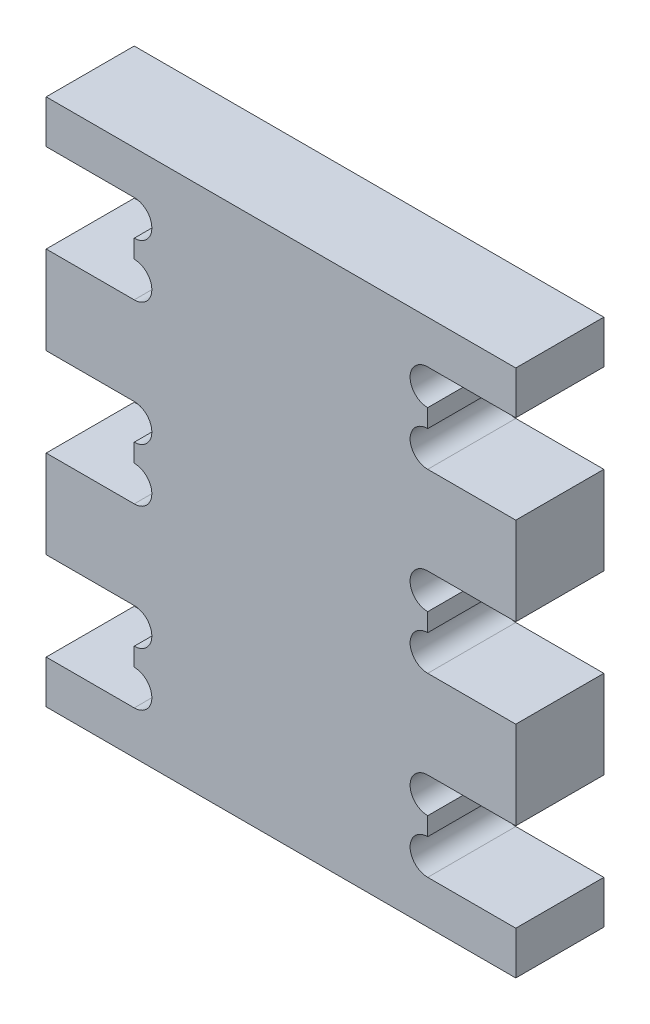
ISO-10303-21;
HEADER;
FILE_DESCRIPTION(('STEP AP214'),'2;1');
FILE_NAME('part.step','',(''),(''),'','','');
FILE_SCHEMA(('AUTOMOTIVE_DESIGN { 1 0 10303 214 1 1 1 1 }'));
ENDSEC;
DATA;
#1=APPLICATION_CONTEXT('core data for automotive mechanical design processes');
#2=APPLICATION_PROTOCOL_DEFINITION('international standard','automotive_design',2000,#1);
#3=PRODUCT_CONTEXT('',#1,'mechanical');
#4=PRODUCT('Part','Part','',(#3));
#5=PRODUCT_RELATED_PRODUCT_CATEGORY('part','',(#4));
#6=PRODUCT_DEFINITION_FORMATION('','',#4);
#7=PRODUCT_DEFINITION_CONTEXT('part definition',#1,'design');
#8=PRODUCT_DEFINITION('design','',#6,#7);
#9=PRODUCT_DEFINITION_SHAPE('','',#8);
#10=(LENGTH_UNIT() NAMED_UNIT(*) SI_UNIT(.MILLI.,.METRE.));
#11=(NAMED_UNIT(*) PLANE_ANGLE_UNIT() SI_UNIT($,.RADIAN.));
#12=(NAMED_UNIT(*) SI_UNIT($,.STERADIAN.) SOLID_ANGLE_UNIT());
#13=UNCERTAINTY_MEASURE_WITH_UNIT(LENGTH_MEASURE(1.E-05),#10,'distance_accuracy_value','');
#14=(GEOMETRIC_REPRESENTATION_CONTEXT(3) GLOBAL_UNCERTAINTY_ASSIGNED_CONTEXT((#13)) GLOBAL_UNIT_ASSIGNED_CONTEXT((#10,
#11,#12)) REPRESENTATION_CONTEXT('',''));
#15=CARTESIAN_POINT('',(0.,0.,0.));
#16=DIRECTION('',(0.,0.,1.));
#17=DIRECTION('',(1.,0.,0.));
#18=AXIS2_PLACEMENT_3D('',#15,#16,#17);
#19=CARTESIAN_POINT('',(50.,0.,15.));
#20=DIRECTION('',(0.,1.,0.));
#21=DIRECTION('',(0.,0.,1.));
#22=AXIS2_PLACEMENT_3D('',#19,#20,#21);
#23=PLANE('',#22);
#24=DIRECTION('',(1.,0.,0.));
#25=VECTOR('',#24,1.);
#26=CARTESIAN_POINT('',(50.,0.,0.));
#27=LINE('',#26,#25);
#28=CARTESIAN_POINT('',(-15.,0.,0.));
#29=VERTEX_POINT('',#28);
#30=CARTESIAN_POINT('',(65.,0.,0.));
#31=VERTEX_POINT('',#30);
#32=EDGE_CURVE('E181',#29,#31,#27,.T.);
#33=ORIENTED_EDGE('',*,*,#32,.T.);
#34=DIRECTION('',(0.,0.,-1.));
#35=VECTOR('',#34,1.);
#36=CARTESIAN_POINT('',(65.,0.,15.));
#37=LINE('',#36,#35);
#38=CARTESIAN_POINT('',(65.,0.,15.));
#39=VERTEX_POINT('',#38);
#40=EDGE_CURVE('E11',#39,#31,#37,.T.);
#41=ORIENTED_EDGE('',*,*,#40,.F.);
#42=DIRECTION('',(1.,0.,0.));
#43=VECTOR('',#42,1.);
#44=CARTESIAN_POINT('',(-15.,0.,15.));
#45=LINE('',#44,#43);
#46=CARTESIAN_POINT('',(-15.,0.,15.));
#47=VERTEX_POINT('',#46);
#48=EDGE_CURVE('E187',#47,#39,#45,.T.);
#49=ORIENTED_EDGE('',*,*,#48,.F.);
#50=DIRECTION('',(0.,0.,-1.));
#51=VECTOR('',#50,1.);
#52=CARTESIAN_POINT('',(-15.,0.,15.));
#53=LINE('',#52,#51);
#54=EDGE_CURVE('E317',#47,#29,#53,.T.);
#55=ORIENTED_EDGE('',*,*,#54,.T.);
#56=EDGE_LOOP('',(#33,#41,#49,#55));
#57=FACE_BOUND('',#56,.T.);
#58=ADVANCED_FACE('F33',(#57),#23,.F.);
#59=CARTESIAN_POINT('',(65.,0.,15.));
#60=DIRECTION('',(-1.,0.,0.));
#61=DIRECTION('',(0.,0.,1.));
#62=AXIS2_PLACEMENT_3D('',#59,#60,#61);
#63=PLANE('',#62);
#64=DIRECTION('',(0.,1.,0.));
#65=VECTOR('',#64,1.);
#66=CARTESIAN_POINT('',(65.,0.,0.));
#67=LINE('',#66,#65);
#68=CARTESIAN_POINT('',(65.,7.35,0.));
#69=VERTEX_POINT('',#68);
#70=EDGE_CURVE('E322',#31,#69,#67,.T.);
#71=ORIENTED_EDGE('',*,*,#70,.T.);
#72=DIRECTION('',(0.,0.,-1.));
#73=VECTOR('',#72,1.);
#74=CARTESIAN_POINT('',(65.,7.35,15.));
#75=LINE('',#74,#73);
#76=CARTESIAN_POINT('',(65.,7.35,15.));
#77=VERTEX_POINT('',#76);
#78=EDGE_CURVE('E41',#77,#69,#75,.T.);
#79=ORIENTED_EDGE('',*,*,#78,.F.);
#80=DIRECTION('',(0.,1.,0.));
#81=VECTOR('',#80,1.);
#82=CARTESIAN_POINT('',(65.,0.,15.));
#83=LINE('',#82,#81);
#84=EDGE_CURVE('E607',#39,#77,#83,.T.);
#85=ORIENTED_EDGE('',*,*,#84,.F.);
#86=ORIENTED_EDGE('',*,*,#40,.T.);
#87=EDGE_LOOP('',(#71,#79,#85,#86));
#88=FACE_BOUND('',#87,.T.);
#89=ADVANCED_FACE('F610',(#88),#63,.F.);
#90=CARTESIAN_POINT('',(65.,7.35,15.));
#91=DIRECTION('',(0.,-1.,0.));
#92=DIRECTION('',(1.,0.,0.));
#93=AXIS2_PLACEMENT_3D('',#90,#91,#92);
#94=PLANE('',#93);
#95=DIRECTION('',(-1.,0.,0.));
#96=VECTOR('',#95,1.);
#97=CARTESIAN_POINT('',(65.,7.35,0.));
#98=LINE('',#97,#96);
#99=CARTESIAN_POINT('',(50.,7.35,0.));
#100=VERTEX_POINT('',#99);
#101=EDGE_CURVE('E324',#69,#100,#98,.T.);
#102=ORIENTED_EDGE('',*,*,#101,.T.);
#103=DIRECTION('',(0.,0.,-1.));
#104=VECTOR('',#103,1.);
#105=CARTESIAN_POINT('',(50.,7.35,15.));
#106=LINE('',#105,#104);
#107=CARTESIAN_POINT('',(50.,7.35,15.));
#108=VERTEX_POINT('',#107);
#109=EDGE_CURVE('E502',#108,#100,#106,.T.);
#110=ORIENTED_EDGE('',*,*,#109,.F.);
#111=DIRECTION('',(-1.,0.,0.));
#112=VECTOR('',#111,1.);
#113=CARTESIAN_POINT('',(65.,7.35,15.));
#114=LINE('',#113,#112);
#115=EDGE_CURVE('E511',#77,#108,#114,.T.);
#116=ORIENTED_EDGE('',*,*,#115,.F.);
#117=ORIENTED_EDGE('',*,*,#78,.T.);
#118=EDGE_LOOP('',(#102,#110,#116,#117));
#119=FACE_BOUND('',#118,.T.);
#120=ADVANCED_FACE('F509',(#119),#94,.F.);
#121=CARTESIAN_POINT('',(50.,10.35,15.));
#122=DIRECTION('',(0.,0.,-1.));
#123=DIRECTION('',(-1.,0.,0.));
#124=AXIS2_PLACEMENT_3D('',#121,#122,#123);
#125=CYLINDRICAL_SURFACE('',#124,3.);
#126=CARTESIAN_POINT('',(50.,10.35,0.));
#127=DIRECTION('',(0.,0.,-1.));
#128=DIRECTION('',(-1.,0.,0.));
#129=AXIS2_PLACEMENT_3D('',#126,#127,#128);
#130=CIRCLE('',#129,3.);
#131=CARTESIAN_POINT('',(50.,13.35,0.));
#132=VERTEX_POINT('',#131);
#133=EDGE_CURVE('E326',#100,#132,#130,.T.);
#134=ORIENTED_EDGE('',*,*,#133,.T.);
#135=DIRECTION('',(0.,0.,-1.));
#136=VECTOR('',#135,1.);
#137=CARTESIAN_POINT('',(50.,13.35,15.));
#138=LINE('',#137,#136);
#139=CARTESIAN_POINT('',(50.,13.35,15.));
#140=VERTEX_POINT('',#139);
#141=EDGE_CURVE('E499',#140,#132,#138,.T.);
#142=ORIENTED_EDGE('',*,*,#141,.F.);
#143=CARTESIAN_POINT('',(50.,10.35,15.));
#144=DIRECTION('',(0.,0.,-1.));
#145=DIRECTION('',(-1.,0.,0.));
#146=AXIS2_PLACEMENT_3D('',#143,#144,#145);
#147=CIRCLE('',#146,3.);
#148=EDGE_CURVE('E529',#108,#140,#147,.T.);
#149=ORIENTED_EDGE('',*,*,#148,.F.);
#150=ORIENTED_EDGE('',*,*,#109,.T.);
#151=EDGE_LOOP('',(#134,#142,#149,#150));
#152=FACE_BOUND('',#151,.T.);
#153=ADVANCED_FACE('F520',(#152),#125,.F.);
#154=CARTESIAN_POINT('',(50.,13.35,15.));
#155=DIRECTION('',(-1.,0.,0.));
#156=DIRECTION('',(0.,0.,1.));
#157=AXIS2_PLACEMENT_3D('',#154,#155,#156);
#158=PLANE('',#157);
#159=DIRECTION('',(0.,1.,0.));
#160=VECTOR('',#159,1.);
#161=CARTESIAN_POINT('',(50.,13.35,0.));
#162=LINE('',#161,#160);
#163=CARTESIAN_POINT('',(50.,16.45,0.));
#164=VERTEX_POINT('',#163);
#165=EDGE_CURVE('E328',#132,#164,#162,.T.);
#166=ORIENTED_EDGE('',*,*,#165,.T.);
#167=DIRECTION('',(0.,0.,-1.));
#168=VECTOR('',#167,1.);
#169=CARTESIAN_POINT('',(50.,16.45,15.));
#170=LINE('',#169,#168);
#171=CARTESIAN_POINT('',(50.,16.45,15.));
#172=VERTEX_POINT('',#171);
#173=EDGE_CURVE('E496',#172,#164,#170,.T.);
#174=ORIENTED_EDGE('',*,*,#173,.F.);
#175=DIRECTION('',(0.,1.,0.));
#176=VECTOR('',#175,1.);
#177=CARTESIAN_POINT('',(50.,13.35,15.));
#178=LINE('',#177,#176);
#179=EDGE_CURVE('E526',#140,#172,#178,.T.);
#180=ORIENTED_EDGE('',*,*,#179,.F.);
#181=ORIENTED_EDGE('',*,*,#141,.T.);
#182=EDGE_LOOP('',(#166,#174,#180,#181));
#183=FACE_BOUND('',#182,.T.);
#184=ADVANCED_FACE('F524',(#183),#158,.F.);
#185=CARTESIAN_POINT('',(50.,19.45,15.));
#186=DIRECTION('',(0.,0.,-1.));
#187=DIRECTION('',(-1.,0.,0.));
#188=AXIS2_PLACEMENT_3D('',#185,#186,#187);
#189=CYLINDRICAL_SURFACE('',#188,3.);
#190=CARTESIAN_POINT('',(50.,19.45,0.));
#191=DIRECTION('',(0.,0.,-1.));
#192=DIRECTION('',(-1.,0.,0.));
#193=AXIS2_PLACEMENT_3D('',#190,#191,#192);
#194=CIRCLE('',#193,3.);
#195=CARTESIAN_POINT('',(50.,22.45,0.));
#196=VERTEX_POINT('',#195);
#197=EDGE_CURVE('E330',#164,#196,#194,.T.);
#198=ORIENTED_EDGE('',*,*,#197,.T.);
#199=DIRECTION('',(0.,0.,-1.));
#200=VECTOR('',#199,1.);
#201=CARTESIAN_POINT('',(50.,22.45,15.));
#202=LINE('',#201,#200);
#203=CARTESIAN_POINT('',(50.,22.45,15.));
#204=VERTEX_POINT('',#203);
#205=EDGE_CURVE('E493',#204,#196,#202,.T.);
#206=ORIENTED_EDGE('',*,*,#205,.F.);
#207=CARTESIAN_POINT('',(50.,19.45,15.));
#208=DIRECTION('',(0.,0.,-1.));
#209=DIRECTION('',(-1.,0.,0.));
#210=AXIS2_PLACEMENT_3D('',#207,#208,#209);
#211=CIRCLE('',#210,3.);
#212=EDGE_CURVE('E528',#172,#204,#211,.T.);
#213=ORIENTED_EDGE('',*,*,#212,.F.);
#214=ORIENTED_EDGE('',*,*,#173,.T.);
#215=EDGE_LOOP('',(#198,#206,#213,#214));
#216=FACE_BOUND('',#215,.T.);
#217=ADVANCED_FACE('F622',(#216),#189,.F.);
#218=CARTESIAN_POINT('',(50.,22.45,15.));
#219=DIRECTION('',(0.,1.,0.));
#220=DIRECTION('',(0.,0.,1.));
#221=AXIS2_PLACEMENT_3D('',#218,#219,#220);
#222=PLANE('',#221);
#223=DIRECTION('',(1.,0.,0.));
#224=VECTOR('',#223,1.);
#225=CARTESIAN_POINT('',(50.,22.45,0.));
#226=LINE('',#225,#224);
#227=CARTESIAN_POINT('',(65.,22.45,0.));
#228=VERTEX_POINT('',#227);
#229=EDGE_CURVE('E332',#196,#228,#226,.T.);
#230=ORIENTED_EDGE('',*,*,#229,.T.);
#231=DIRECTION('',(0.,0.,-1.));
#232=VECTOR('',#231,1.);
#233=CARTESIAN_POINT('',(65.,22.45,15.));
#234=LINE('',#233,#232);
#235=CARTESIAN_POINT('',(65.,22.45,15.));
#236=VERTEX_POINT('',#235);
#237=EDGE_CURVE('E490',#236,#228,#234,.T.);
#238=ORIENTED_EDGE('',*,*,#237,.F.);
#239=DIRECTION('',(1.,0.,0.));
#240=VECTOR('',#239,1.);
#241=CARTESIAN_POINT('',(50.,22.45,15.));
#242=LINE('',#241,#240);
#243=EDGE_CURVE('E531',#204,#236,#242,.T.);
#244=ORIENTED_EDGE('',*,*,#243,.F.);
#245=ORIENTED_EDGE('',*,*,#205,.T.);
#246=EDGE_LOOP('',(#230,#238,#244,#245));
#247=FACE_BOUND('',#246,.T.);
#248=ADVANCED_FACE('F625',(#247),#222,.F.);
#249=CARTESIAN_POINT('',(65.,22.45,15.));
#250=DIRECTION('',(-1.,0.,0.));
#251=DIRECTION('',(0.,0.,1.));
#252=AXIS2_PLACEMENT_3D('',#249,#250,#251);
#253=PLANE('',#252);
#254=DIRECTION('',(0.,1.,0.));
#255=VECTOR('',#254,1.);
#256=CARTESIAN_POINT('',(65.,22.45,0.));
#257=LINE('',#256,#255);
#258=CARTESIAN_POINT('',(65.,37.45,0.));
#259=VERTEX_POINT('',#258);
#260=EDGE_CURVE('E334',#228,#259,#257,.T.);
#261=ORIENTED_EDGE('',*,*,#260,.T.);
#262=DIRECTION('',(0.,0.,-1.));
#263=VECTOR('',#262,1.);
#264=CARTESIAN_POINT('',(65.,37.45,15.));
#265=LINE('',#264,#263);
#266=CARTESIAN_POINT('',(65.,37.45,15.));
#267=VERTEX_POINT('',#266);
#268=EDGE_CURVE('E487',#267,#259,#265,.T.);
#269=ORIENTED_EDGE('',*,*,#268,.F.);
#270=DIRECTION('',(0.,1.,0.));
#271=VECTOR('',#270,1.);
#272=CARTESIAN_POINT('',(65.,22.45,15.));
#273=LINE('',#272,#271);
#274=EDGE_CURVE('E537',#236,#267,#273,.T.);
#275=ORIENTED_EDGE('',*,*,#274,.F.);
#276=ORIENTED_EDGE('',*,*,#237,.T.);
#277=EDGE_LOOP('',(#261,#269,#275,#276));
#278=FACE_BOUND('',#277,.T.);
#279=ADVANCED_FACE('F629',(#278),#253,.F.);
#280=CARTESIAN_POINT('',(65.,37.45,15.));
#281=DIRECTION('',(0.,-1.,0.));
#282=DIRECTION('',(1.,0.,0.));
#283=AXIS2_PLACEMENT_3D('',#280,#281,#282);
#284=PLANE('',#283);
#285=DIRECTION('',(-1.,0.,0.));
#286=VECTOR('',#285,1.);
#287=CARTESIAN_POINT('',(65.,37.45,0.));
#288=LINE('',#287,#286);
#289=CARTESIAN_POINT('',(50.,37.45,0.));
#290=VERTEX_POINT('',#289);
#291=EDGE_CURVE('E336',#259,#290,#288,.T.);
#292=ORIENTED_EDGE('',*,*,#291,.T.);
#293=DIRECTION('',(0.,0.,-1.));
#294=VECTOR('',#293,1.);
#295=CARTESIAN_POINT('',(50.,37.45,15.));
#296=LINE('',#295,#294);
#297=CARTESIAN_POINT('',(50.,37.45,15.));
#298=VERTEX_POINT('',#297);
#299=EDGE_CURVE('E484',#298,#290,#296,.T.);
#300=ORIENTED_EDGE('',*,*,#299,.F.);
#301=DIRECTION('',(-1.,0.,0.));
#302=VECTOR('',#301,1.);
#303=CARTESIAN_POINT('',(65.,37.45,15.));
#304=LINE('',#303,#302);
#305=EDGE_CURVE('E539',#267,#298,#304,.T.);
#306=ORIENTED_EDGE('',*,*,#305,.F.);
#307=ORIENTED_EDGE('',*,*,#268,.T.);
#308=EDGE_LOOP('',(#292,#300,#306,#307));
#309=FACE_BOUND('',#308,.T.);
#310=ADVANCED_FACE('F633',(#309),#284,.F.);
#311=CARTESIAN_POINT('',(50.,40.45,15.));
#312=DIRECTION('',(0.,0.,-1.));
#313=DIRECTION('',(-1.,0.,0.));
#314=AXIS2_PLACEMENT_3D('',#311,#312,#313);
#315=CYLINDRICAL_SURFACE('',#314,3.);
#316=CARTESIAN_POINT('',(50.,40.45,0.));
#317=DIRECTION('',(0.,0.,-1.));
#318=DIRECTION('',(-1.,0.,0.));
#319=AXIS2_PLACEMENT_3D('',#316,#317,#318);
#320=CIRCLE('',#319,3.);
#321=CARTESIAN_POINT('',(50.,43.45,0.));
#322=VERTEX_POINT('',#321);
#323=EDGE_CURVE('E338',#290,#322,#320,.T.);
#324=ORIENTED_EDGE('',*,*,#323,.T.);
#325=DIRECTION('',(0.,0.,-1.));
#326=VECTOR('',#325,1.);
#327=CARTESIAN_POINT('',(50.,43.45,15.));
#328=LINE('',#327,#326);
#329=CARTESIAN_POINT('',(50.,43.45,15.));
#330=VERTEX_POINT('',#329);
#331=EDGE_CURVE('E481',#330,#322,#328,.T.);
#332=ORIENTED_EDGE('',*,*,#331,.F.);
#333=CARTESIAN_POINT('',(50.,40.45,15.));
#334=DIRECTION('',(0.,0.,-1.));
#335=DIRECTION('',(-1.,0.,0.));
#336=AXIS2_PLACEMENT_3D('',#333,#334,#335);
#337=CIRCLE('',#336,3.);
#338=EDGE_CURVE('E541',#298,#330,#337,.T.);
#339=ORIENTED_EDGE('',*,*,#338,.F.);
#340=ORIENTED_EDGE('',*,*,#299,.T.);
#341=EDGE_LOOP('',(#324,#332,#339,#340));
#342=FACE_BOUND('',#341,.T.);
#343=ADVANCED_FACE('F637',(#342),#315,.F.);
#344=CARTESIAN_POINT('',(50.,43.45,15.));
#345=DIRECTION('',(-1.,0.,0.));
#346=DIRECTION('',(0.,0.,1.));
#347=AXIS2_PLACEMENT_3D('',#344,#345,#346);
#348=PLANE('',#347);
#349=DIRECTION('',(0.,1.,0.));
#350=VECTOR('',#349,1.);
#351=CARTESIAN_POINT('',(50.,43.45,0.));
#352=LINE('',#351,#350);
#353=CARTESIAN_POINT('',(50.,46.55,0.));
#354=VERTEX_POINT('',#353);
#355=EDGE_CURVE('E340',#322,#354,#352,.T.);
#356=ORIENTED_EDGE('',*,*,#355,.T.);
#357=DIRECTION('',(0.,0.,-1.));
#358=VECTOR('',#357,1.);
#359=CARTESIAN_POINT('',(50.,46.55,15.));
#360=LINE('',#359,#358);
#361=CARTESIAN_POINT('',(50.,46.55,15.));
#362=VERTEX_POINT('',#361);
#363=EDGE_CURVE('E478',#362,#354,#360,.T.);
#364=ORIENTED_EDGE('',*,*,#363,.F.);
#365=DIRECTION('',(0.,1.,0.));
#366=VECTOR('',#365,1.);
#367=CARTESIAN_POINT('',(50.,43.45,15.));
#368=LINE('',#367,#366);
#369=EDGE_CURVE('E543',#330,#362,#368,.T.);
#370=ORIENTED_EDGE('',*,*,#369,.F.);
#371=ORIENTED_EDGE('',*,*,#331,.T.);
#372=EDGE_LOOP('',(#356,#364,#370,#371));
#373=FACE_BOUND('',#372,.T.);
#374=ADVANCED_FACE('F641',(#373),#348,.F.);
#375=CARTESIAN_POINT('',(50.,49.55,15.));
#376=DIRECTION('',(0.,0.,-1.));
#377=DIRECTION('',(-1.,0.,0.));
#378=AXIS2_PLACEMENT_3D('',#375,#376,#377);
#379=CYLINDRICAL_SURFACE('',#378,3.);
#380=CARTESIAN_POINT('',(50.,49.55,0.));
#381=DIRECTION('',(0.,0.,-1.));
#382=DIRECTION('',(1.,0.,0.));
#383=AXIS2_PLACEMENT_3D('',#380,#381,#382);
#384=CIRCLE('',#383,3.);
#385=CARTESIAN_POINT('',(50.,52.55,0.));
#386=VERTEX_POINT('',#385);
#387=EDGE_CURVE('E342',#354,#386,#384,.T.);
#388=ORIENTED_EDGE('',*,*,#387,.T.);
#389=DIRECTION('',(0.,0.,-1.));
#390=VECTOR('',#389,1.);
#391=CARTESIAN_POINT('',(50.,52.55,15.));
#392=LINE('',#391,#390);
#393=CARTESIAN_POINT('',(50.,52.55,15.));
#394=VERTEX_POINT('',#393);
#395=EDGE_CURVE('E475',#394,#386,#392,.T.);
#396=ORIENTED_EDGE('',*,*,#395,.F.);
#397=CARTESIAN_POINT('',(50.,49.55,15.));
#398=DIRECTION('',(0.,0.,-1.));
#399=DIRECTION('',(1.,0.,0.));
#400=AXIS2_PLACEMENT_3D('',#397,#398,#399);
#401=CIRCLE('',#400,3.);
#402=EDGE_CURVE('E545',#362,#394,#401,.T.);
#403=ORIENTED_EDGE('',*,*,#402,.F.);
#404=ORIENTED_EDGE('',*,*,#363,.T.);
#405=EDGE_LOOP('',(#388,#396,#403,#404));
#406=FACE_BOUND('',#405,.T.);
#407=ADVANCED_FACE('F645',(#406),#379,.F.);
#408=CARTESIAN_POINT('',(50.,52.55,15.));
#409=DIRECTION('',(0.,1.,0.));
#410=DIRECTION('',(0.,0.,1.));
#411=AXIS2_PLACEMENT_3D('',#408,#409,#410);
#412=PLANE('',#411);
#413=DIRECTION('',(1.,0.,0.));
#414=VECTOR('',#413,1.);
#415=CARTESIAN_POINT('',(50.,52.55,0.));
#416=LINE('',#415,#414);
#417=CARTESIAN_POINT('',(65.,52.55,0.));
#418=VERTEX_POINT('',#417);
#419=EDGE_CURVE('E344',#386,#418,#416,.T.);
#420=ORIENTED_EDGE('',*,*,#419,.T.);
#421=DIRECTION('',(0.,0.,-1.));
#422=VECTOR('',#421,1.);
#423=CARTESIAN_POINT('',(65.,52.55,15.));
#424=LINE('',#423,#422);
#425=CARTESIAN_POINT('',(65.,52.55,15.));
#426=VERTEX_POINT('',#425);
#427=EDGE_CURVE('E472',#426,#418,#424,.T.);
#428=ORIENTED_EDGE('',*,*,#427,.F.);
#429=DIRECTION('',(1.,0.,0.));
#430=VECTOR('',#429,1.);
#431=CARTESIAN_POINT('',(50.,52.55,15.));
#432=LINE('',#431,#430);
#433=EDGE_CURVE('E547',#394,#426,#432,.T.);
#434=ORIENTED_EDGE('',*,*,#433,.F.);
#435=ORIENTED_EDGE('',*,*,#395,.T.);
#436=EDGE_LOOP('',(#420,#428,#434,#435));
#437=FACE_BOUND('',#436,.T.);
#438=ADVANCED_FACE('F649',(#437),#412,.F.);
#439=CARTESIAN_POINT('',(65.,52.55,15.));
#440=DIRECTION('',(-1.,0.,0.));
#441=DIRECTION('',(0.,0.,1.));
#442=AXIS2_PLACEMENT_3D('',#439,#440,#441);
#443=PLANE('',#442);
#444=DIRECTION('',(0.,1.,0.));
#445=VECTOR('',#444,1.);
#446=CARTESIAN_POINT('',(65.,52.55,0.));
#447=LINE('',#446,#445);
#448=CARTESIAN_POINT('',(65.,67.55,0.));
#449=VERTEX_POINT('',#448);
#450=EDGE_CURVE('E346',#418,#449,#447,.T.);
#451=ORIENTED_EDGE('',*,*,#450,.T.);
#452=DIRECTION('',(0.,0.,-1.));
#453=VECTOR('',#452,1.);
#454=CARTESIAN_POINT('',(65.,67.55,15.));
#455=LINE('',#454,#453);
#456=CARTESIAN_POINT('',(65.,67.55,15.));
#457=VERTEX_POINT('',#456);
#458=EDGE_CURVE('E469',#457,#449,#455,.T.);
#459=ORIENTED_EDGE('',*,*,#458,.F.);
#460=DIRECTION('',(0.,1.,0.));
#461=VECTOR('',#460,1.);
#462=CARTESIAN_POINT('',(65.,52.55,15.));
#463=LINE('',#462,#461);
#464=EDGE_CURVE('E549',#426,#457,#463,.T.);
#465=ORIENTED_EDGE('',*,*,#464,.F.);
#466=ORIENTED_EDGE('',*,*,#427,.T.);
#467=EDGE_LOOP('',(#451,#459,#465,#466));
#468=FACE_BOUND('',#467,.T.);
#469=ADVANCED_FACE('F653',(#468),#443,.F.);
#470=CARTESIAN_POINT('',(65.,67.55,15.));
#471=DIRECTION('',(0.,-1.,0.));
#472=DIRECTION('',(0.,0.,-1.));
#473=AXIS2_PLACEMENT_3D('',#470,#471,#472);
#474=PLANE('',#473);
#475=DIRECTION('',(-1.,0.,0.));
#476=VECTOR('',#475,1.);
#477=CARTESIAN_POINT('',(65.,67.55,0.));
#478=LINE('',#477,#476);
#479=CARTESIAN_POINT('',(50.,67.55,0.));
#480=VERTEX_POINT('',#479);
#481=EDGE_CURVE('E348',#449,#480,#478,.T.);
#482=ORIENTED_EDGE('',*,*,#481,.T.);
#483=DIRECTION('',(0.,0.,-1.));
#484=VECTOR('',#483,1.);
#485=CARTESIAN_POINT('',(50.,67.55,15.));
#486=LINE('',#485,#484);
#487=CARTESIAN_POINT('',(50.,67.55,15.));
#488=VERTEX_POINT('',#487);
#489=EDGE_CURVE('E466',#488,#480,#486,.T.);
#490=ORIENTED_EDGE('',*,*,#489,.F.);
#491=DIRECTION('',(-1.,0.,0.));
#492=VECTOR('',#491,1.);
#493=CARTESIAN_POINT('',(65.,67.55,15.));
#494=LINE('',#493,#492);
#495=EDGE_CURVE('E551',#457,#488,#494,.T.);
#496=ORIENTED_EDGE('',*,*,#495,.F.);
#497=ORIENTED_EDGE('',*,*,#458,.T.);
#498=EDGE_LOOP('',(#482,#490,#496,#497));
#499=FACE_BOUND('',#498,.T.);
#500=ADVANCED_FACE('F657',(#499),#474,.F.);
#501=CARTESIAN_POINT('',(50.,70.55,15.));
#502=DIRECTION('',(0.,0.,-1.));
#503=DIRECTION('',(-1.,0.,0.));
#504=AXIS2_PLACEMENT_3D('',#501,#502,#503);
#505=CYLINDRICAL_SURFACE('',#504,3.);
#506=CARTESIAN_POINT('',(50.,70.55,0.));
#507=DIRECTION('',(0.,0.,-1.));
#508=DIRECTION('',(-1.,0.,0.));
#509=AXIS2_PLACEMENT_3D('',#506,#507,#508);
#510=CIRCLE('',#509,3.);
#511=CARTESIAN_POINT('',(50.,73.55,0.));
#512=VERTEX_POINT('',#511);
#513=EDGE_CURVE('E350',#480,#512,#510,.T.);
#514=ORIENTED_EDGE('',*,*,#513,.T.);
#515=DIRECTION('',(0.,0.,-1.));
#516=VECTOR('',#515,1.);
#517=CARTESIAN_POINT('',(50.,73.55,15.));
#518=LINE('',#517,#516);
#519=CARTESIAN_POINT('',(50.,73.55,15.));
#520=VERTEX_POINT('',#519);
#521=EDGE_CURVE('E463',#520,#512,#518,.T.);
#522=ORIENTED_EDGE('',*,*,#521,.F.);
#523=CARTESIAN_POINT('',(50.,70.55,15.));
#524=DIRECTION('',(0.,0.,-1.));
#525=DIRECTION('',(-1.,0.,0.));
#526=AXIS2_PLACEMENT_3D('',#523,#524,#525);
#527=CIRCLE('',#526,3.);
#528=EDGE_CURVE('E553',#488,#520,#527,.T.);
#529=ORIENTED_EDGE('',*,*,#528,.F.);
#530=ORIENTED_EDGE('',*,*,#489,.T.);
#531=EDGE_LOOP('',(#514,#522,#529,#530));
#532=FACE_BOUND('',#531,.T.);
#533=ADVANCED_FACE('F661',(#532),#505,.F.);
#534=CARTESIAN_POINT('',(50.,73.55,15.));
#535=DIRECTION('',(-1.,0.,0.));
#536=DIRECTION('',(0.,0.,1.));
#537=AXIS2_PLACEMENT_3D('',#534,#535,#536);
#538=PLANE('',#537);
#539=DIRECTION('',(0.,1.,0.));
#540=VECTOR('',#539,1.);
#541=CARTESIAN_POINT('',(50.,73.55,0.));
#542=LINE('',#541,#540);
#543=CARTESIAN_POINT('',(50.,76.65,0.));
#544=VERTEX_POINT('',#543);
#545=EDGE_CURVE('E352',#512,#544,#542,.T.);
#546=ORIENTED_EDGE('',*,*,#545,.T.);
#547=DIRECTION('',(0.,0.,-1.));
#548=VECTOR('',#547,1.);
#549=CARTESIAN_POINT('',(50.,76.65,15.));
#550=LINE('',#549,#548);
#551=CARTESIAN_POINT('',(50.,76.65,15.));
#552=VERTEX_POINT('',#551);
#553=EDGE_CURVE('E460',#552,#544,#550,.T.);
#554=ORIENTED_EDGE('',*,*,#553,.F.);
#555=DIRECTION('',(0.,1.,0.));
#556=VECTOR('',#555,1.);
#557=CARTESIAN_POINT('',(50.,73.55,15.));
#558=LINE('',#557,#556);
#559=EDGE_CURVE('E555',#520,#552,#558,.T.);
#560=ORIENTED_EDGE('',*,*,#559,.F.);
#561=ORIENTED_EDGE('',*,*,#521,.T.);
#562=EDGE_LOOP('',(#546,#554,#560,#561));
#563=FACE_BOUND('',#562,.T.);
#564=ADVANCED_FACE('F665',(#563),#538,.F.);
#565=CARTESIAN_POINT('',(50.,79.65,15.));
#566=DIRECTION('',(0.,0.,-1.));
#567=DIRECTION('',(-1.,0.,0.));
#568=AXIS2_PLACEMENT_3D('',#565,#566,#567);
#569=CYLINDRICAL_SURFACE('',#568,3.);
#570=CARTESIAN_POINT('',(50.,79.65,0.));
#571=DIRECTION('',(0.,0.,-1.));
#572=DIRECTION('',(-1.,0.,0.));
#573=AXIS2_PLACEMENT_3D('',#570,#571,#572);
#574=CIRCLE('',#573,3.);
#575=CARTESIAN_POINT('',(50.,82.65,0.));
#576=VERTEX_POINT('',#575);
#577=EDGE_CURVE('E354',#544,#576,#574,.T.);
#578=ORIENTED_EDGE('',*,*,#577,.T.);
#579=DIRECTION('',(0.,0.,-1.));
#580=VECTOR('',#579,1.);
#581=CARTESIAN_POINT('',(50.,82.65,15.));
#582=LINE('',#581,#580);
#583=CARTESIAN_POINT('',(50.,82.65,15.));
#584=VERTEX_POINT('',#583);
#585=EDGE_CURVE('E457',#584,#576,#582,.T.);
#586=ORIENTED_EDGE('',*,*,#585,.F.);
#587=CARTESIAN_POINT('',(50.,79.65,15.));
#588=DIRECTION('',(0.,0.,-1.));
#589=DIRECTION('',(-1.,0.,0.));
#590=AXIS2_PLACEMENT_3D('',#587,#588,#589);
#591=CIRCLE('',#590,3.);
#592=EDGE_CURVE('E557',#552,#584,#591,.T.);
#593=ORIENTED_EDGE('',*,*,#592,.F.);
#594=ORIENTED_EDGE('',*,*,#553,.T.);
#595=EDGE_LOOP('',(#578,#586,#593,#594));
#596=FACE_BOUND('',#595,.T.);
#597=ADVANCED_FACE('F669',(#596),#569,.F.);
#598=CARTESIAN_POINT('',(50.,82.65,15.));
#599=DIRECTION('',(0.,1.,0.));
#600=DIRECTION('',(0.,0.,1.));
#601=AXIS2_PLACEMENT_3D('',#598,#599,#600);
#602=PLANE('',#601);
#603=DIRECTION('',(1.,0.,0.));
#604=VECTOR('',#603,1.);
#605=CARTESIAN_POINT('',(50.,82.65,0.));
#606=LINE('',#605,#604);
#607=CARTESIAN_POINT('',(65.,82.65,0.));
#608=VERTEX_POINT('',#607);
#609=EDGE_CURVE('E356',#576,#608,#606,.T.);
#610=ORIENTED_EDGE('',*,*,#609,.T.);
#611=DIRECTION('',(0.,0.,-1.));
#612=VECTOR('',#611,1.);
#613=CARTESIAN_POINT('',(65.,82.65,15.));
#614=LINE('',#613,#612);
#615=CARTESIAN_POINT('',(65.,82.65,15.));
#616=VERTEX_POINT('',#615);
#617=EDGE_CURVE('E454',#616,#608,#614,.T.);
#618=ORIENTED_EDGE('',*,*,#617,.F.);
#619=DIRECTION('',(1.,0.,0.));
#620=VECTOR('',#619,1.);
#621=CARTESIAN_POINT('',(50.,82.65,15.));
#622=LINE('',#621,#620);
#623=EDGE_CURVE('E559',#584,#616,#622,.T.);
#624=ORIENTED_EDGE('',*,*,#623,.F.);
#625=ORIENTED_EDGE('',*,*,#585,.T.);
#626=EDGE_LOOP('',(#610,#618,#624,#625));
#627=FACE_BOUND('',#626,.T.);
#628=ADVANCED_FACE('F673',(#627),#602,.F.);
#629=CARTESIAN_POINT('',(65.,82.65,15.));
#630=DIRECTION('',(-1.,0.,0.));
#631=DIRECTION('',(0.,0.,1.));
#632=AXIS2_PLACEMENT_3D('',#629,#630,#631);
#633=PLANE('',#632);
#634=DIRECTION('',(0.,1.,0.));
#635=VECTOR('',#634,1.);
#636=CARTESIAN_POINT('',(65.,82.65,0.));
#637=LINE('',#636,#635);
#638=CARTESIAN_POINT('',(65.,90.,0.));
#639=VERTEX_POINT('',#638);
#640=EDGE_CURVE('E358',#608,#639,#637,.T.);
#641=ORIENTED_EDGE('',*,*,#640,.T.);
#642=DIRECTION('',(0.,0.,-1.));
#643=VECTOR('',#642,1.);
#644=CARTESIAN_POINT('',(65.,90.,15.));
#645=LINE('',#644,#643);
#646=CARTESIAN_POINT('',(65.,90.,15.));
#647=VERTEX_POINT('',#646);
#648=EDGE_CURVE('E451',#647,#639,#645,.T.);
#649=ORIENTED_EDGE('',*,*,#648,.F.);
#650=DIRECTION('',(0.,1.,0.));
#651=VECTOR('',#650,1.);
#652=CARTESIAN_POINT('',(65.,82.65,15.));
#653=LINE('',#652,#651);
#654=EDGE_CURVE('E561',#616,#647,#653,.T.);
#655=ORIENTED_EDGE('',*,*,#654,.F.);
#656=ORIENTED_EDGE('',*,*,#617,.T.);
#657=EDGE_LOOP('',(#641,#649,#655,#656));
#658=FACE_BOUND('',#657,.T.);
#659=ADVANCED_FACE('F677',(#658),#633,.F.);
#660=CARTESIAN_POINT('',(-15.,90.,15.));
#661=DIRECTION('',(0.,-1.,0.));
#662=DIRECTION('',(0.,0.,-1.));
#663=AXIS2_PLACEMENT_3D('',#660,#661,#662);
#664=PLANE('',#663);
#665=DIRECTION('',(-1.,0.,0.));
#666=VECTOR('',#665,1.);
#667=CARTESIAN_POINT('',(-15.,90.,0.));
#668=LINE('',#667,#666);
#669=CARTESIAN_POINT('',(-15.,90.,0.));
#670=VERTEX_POINT('',#669);
#671=EDGE_CURVE('E361',#639,#670,#668,.T.);
#672=ORIENTED_EDGE('',*,*,#671,.T.);
#673=DIRECTION('',(0.,0.,-1.));
#674=VECTOR('',#673,1.);
#675=CARTESIAN_POINT('',(-15.,90.,15.));
#676=LINE('',#675,#674);
#677=CARTESIAN_POINT('',(-15.,90.,15.));
#678=VERTEX_POINT('',#677);
#679=EDGE_CURVE('E448',#678,#670,#676,.T.);
#680=ORIENTED_EDGE('',*,*,#679,.F.);
#681=DIRECTION('',(-1.,0.,0.));
#682=VECTOR('',#681,1.);
#683=CARTESIAN_POINT('',(65.,90.,15.));
#684=LINE('',#683,#682);
#685=EDGE_CURVE('E563',#647,#678,#684,.T.);
#686=ORIENTED_EDGE('',*,*,#685,.F.);
#687=ORIENTED_EDGE('',*,*,#648,.T.);
#688=EDGE_LOOP('',(#672,#680,#686,#687));
#689=FACE_BOUND('',#688,.T.);
#690=ADVANCED_FACE('F681',(#689),#664,.F.);
#691=CARTESIAN_POINT('',(-15.,90.,15.));
#692=DIRECTION('',(1.,0.,0.));
#693=DIRECTION('',(0.,1.,0.));
#694=AXIS2_PLACEMENT_3D('',#691,#692,#693);
#695=PLANE('',#694);
#696=DIRECTION('',(0.,-1.,0.));
#697=VECTOR('',#696,1.);
#698=CARTESIAN_POINT('',(-15.,90.,0.));
#699=LINE('',#698,#697);
#700=CARTESIAN_POINT('',(-15.,82.65,0.));
#701=VERTEX_POINT('',#700);
#702=EDGE_CURVE('E363',#670,#701,#699,.T.);
#703=ORIENTED_EDGE('',*,*,#702,.T.);
#704=DIRECTION('',(0.,0.,-1.));
#705=VECTOR('',#704,1.);
#706=CARTESIAN_POINT('',(-15.,82.65,15.));
#707=LINE('',#706,#705);
#708=CARTESIAN_POINT('',(-15.,82.65,15.));
#709=VERTEX_POINT('',#708);
#710=EDGE_CURVE('E445',#709,#701,#707,.T.);
#711=ORIENTED_EDGE('',*,*,#710,.F.);
#712=DIRECTION('',(0.,-1.,0.));
#713=VECTOR('',#712,1.);
#714=CARTESIAN_POINT('',(-15.,90.,15.));
#715=LINE('',#714,#713);
#716=EDGE_CURVE('E565',#678,#709,#715,.T.);
#717=ORIENTED_EDGE('',*,*,#716,.F.);
#718=ORIENTED_EDGE('',*,*,#679,.T.);
#719=EDGE_LOOP('',(#703,#711,#717,#718));
#720=FACE_BOUND('',#719,.T.);
#721=ADVANCED_FACE('F685',(#720),#695,.F.);
#722=CARTESIAN_POINT('',(-15.,82.65,15.));
#723=DIRECTION('',(0.,1.,0.));
#724=DIRECTION('',(-1.,0.,0.));
#725=AXIS2_PLACEMENT_3D('',#722,#723,#724);
#726=PLANE('',#725);
#727=DIRECTION('',(1.,0.,0.));
#728=VECTOR('',#727,1.);
#729=CARTESIAN_POINT('',(-15.,82.65,0.));
#730=LINE('',#729,#728);
#731=CARTESIAN_POINT('',(0.,82.65,0.));
#732=VERTEX_POINT('',#731);
#733=EDGE_CURVE('E365',#701,#732,#730,.T.);
#734=ORIENTED_EDGE('',*,*,#733,.T.);
#735=DIRECTION('',(0.,0.,-1.));
#736=VECTOR('',#735,1.);
#737=CARTESIAN_POINT('',(0.,82.65,15.));
#738=LINE('',#737,#736);
#739=CARTESIAN_POINT('',(0.,82.65,15.));
#740=VERTEX_POINT('',#739);
#741=EDGE_CURVE('E442',#740,#732,#738,.T.);
#742=ORIENTED_EDGE('',*,*,#741,.F.);
#743=DIRECTION('',(1.,0.,0.));
#744=VECTOR('',#743,1.);
#745=CARTESIAN_POINT('',(-15.,82.65,15.));
#746=LINE('',#745,#744);
#747=EDGE_CURVE('E567',#709,#740,#746,.T.);
#748=ORIENTED_EDGE('',*,*,#747,.F.);
#749=ORIENTED_EDGE('',*,*,#710,.T.);
#750=EDGE_LOOP('',(#734,#742,#748,#749));
#751=FACE_BOUND('',#750,.T.);
#752=ADVANCED_FACE('F689',(#751),#726,.F.);
#753=CARTESIAN_POINT('',(0.,79.65,15.));
#754=DIRECTION('',(0.,0.,-1.));
#755=DIRECTION('',(-1.,0.,0.));
#756=AXIS2_PLACEMENT_3D('',#753,#754,#755);
#757=CYLINDRICAL_SURFACE('',#756,3.00000000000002);
#758=CARTESIAN_POINT('',(0.,79.65,0.));
#759=DIRECTION('',(0.,0.,-1.));
#760=DIRECTION('',(-1.,0.,0.));
#761=AXIS2_PLACEMENT_3D('',#758,#759,#760);
#762=CIRCLE('',#761,3.00000000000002);
#763=CARTESIAN_POINT('',(0.,76.6499999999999,0.));
#764=VERTEX_POINT('',#763);
#765=EDGE_CURVE('E367',#732,#764,#762,.T.);
#766=ORIENTED_EDGE('',*,*,#765,.T.);
#767=DIRECTION('',(0.,0.,-1.));
#768=VECTOR('',#767,1.);
#769=CARTESIAN_POINT('',(0.,76.6499999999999,15.));
#770=LINE('',#769,#768);
#771=CARTESIAN_POINT('',(0.,76.6499999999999,15.));
#772=VERTEX_POINT('',#771);
#773=EDGE_CURVE('E439',#772,#764,#770,.T.);
#774=ORIENTED_EDGE('',*,*,#773,.F.);
#775=CARTESIAN_POINT('',(0.,79.65,15.));
#776=DIRECTION('',(0.,0.,-1.));
#777=DIRECTION('',(-1.,0.,0.));
#778=AXIS2_PLACEMENT_3D('',#775,#776,#777);
#779=CIRCLE('',#778,3.00000000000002);
#780=EDGE_CURVE('E569',#740,#772,#779,.T.);
#781=ORIENTED_EDGE('',*,*,#780,.F.);
#782=ORIENTED_EDGE('',*,*,#741,.T.);
#783=EDGE_LOOP('',(#766,#774,#781,#782));
#784=FACE_BOUND('',#783,.T.);
#785=ADVANCED_FACE('F693',(#784),#757,.F.);
#786=CARTESIAN_POINT('',(0.,76.65,15.));
#787=DIRECTION('',(1.,0.,0.));
#788=DIRECTION('',(0.,1.,0.));
#789=AXIS2_PLACEMENT_3D('',#786,#787,#788);
#790=PLANE('',#789);
#791=DIRECTION('',(0.,-1.,0.));
#792=VECTOR('',#791,1.);
#793=CARTESIAN_POINT('',(0.,76.65,0.));
#794=LINE('',#793,#792);
#795=CARTESIAN_POINT('',(0.,73.55,0.));
#796=VERTEX_POINT('',#795);
#797=EDGE_CURVE('E369',#764,#796,#794,.T.);
#798=ORIENTED_EDGE('',*,*,#797,.T.);
#799=DIRECTION('',(0.,0.,-1.));
#800=VECTOR('',#799,1.);
#801=CARTESIAN_POINT('',(0.,73.55,15.));
#802=LINE('',#801,#800);
#803=CARTESIAN_POINT('',(0.,73.55,15.));
#804=VERTEX_POINT('',#803);
#805=EDGE_CURVE('E436',#804,#796,#802,.T.);
#806=ORIENTED_EDGE('',*,*,#805,.F.);
#807=DIRECTION('',(0.,-1.,0.));
#808=VECTOR('',#807,1.);
#809=CARTESIAN_POINT('',(0.,76.65,15.));
#810=LINE('',#809,#808);
#811=EDGE_CURVE('E571',#772,#804,#810,.T.);
#812=ORIENTED_EDGE('',*,*,#811,.F.);
#813=ORIENTED_EDGE('',*,*,#773,.T.);
#814=EDGE_LOOP('',(#798,#806,#812,#813));
#815=FACE_BOUND('',#814,.T.);
#816=ADVANCED_FACE('F697',(#815),#790,.F.);
#817=CARTESIAN_POINT('',(0.,70.55,15.));
#818=DIRECTION('',(0.,0.,-1.));
#819=DIRECTION('',(-1.,0.,0.));
#820=AXIS2_PLACEMENT_3D('',#817,#818,#819);
#821=CYLINDRICAL_SURFACE('',#820,3.);
#822=CARTESIAN_POINT('',(0.,70.55,0.));
#823=DIRECTION('',(0.,0.,-1.));
#824=DIRECTION('',(-1.,0.,0.));
#825=AXIS2_PLACEMENT_3D('',#822,#823,#824);
#826=CIRCLE('',#825,3.);
#827=CARTESIAN_POINT('',(0.,67.55,0.));
#828=VERTEX_POINT('',#827);
#829=EDGE_CURVE('E371',#796,#828,#826,.T.);
#830=ORIENTED_EDGE('',*,*,#829,.T.);
#831=DIRECTION('',(0.,0.,-1.));
#832=VECTOR('',#831,1.);
#833=CARTESIAN_POINT('',(0.,67.55,15.));
#834=LINE('',#833,#832);
#835=CARTESIAN_POINT('',(0.,67.55,15.));
#836=VERTEX_POINT('',#835);
#837=EDGE_CURVE('E433',#836,#828,#834,.T.);
#838=ORIENTED_EDGE('',*,*,#837,.F.);
#839=CARTESIAN_POINT('',(0.,70.55,15.));
#840=DIRECTION('',(0.,0.,-1.));
#841=DIRECTION('',(-1.,0.,0.));
#842=AXIS2_PLACEMENT_3D('',#839,#840,#841);
#843=CIRCLE('',#842,3.);
#844=EDGE_CURVE('E573',#804,#836,#843,.T.);
#845=ORIENTED_EDGE('',*,*,#844,.F.);
#846=ORIENTED_EDGE('',*,*,#805,.T.);
#847=EDGE_LOOP('',(#830,#838,#845,#846));
#848=FACE_BOUND('',#847,.T.);
#849=ADVANCED_FACE('F701',(#848),#821,.F.);
#850=CARTESIAN_POINT('',(0.,67.55,15.));
#851=DIRECTION('',(0.,-1.,0.));
#852=DIRECTION('',(1.,0.,0.));
#853=AXIS2_PLACEMENT_3D('',#850,#851,#852);
#854=PLANE('',#853);
#855=DIRECTION('',(-1.,0.,0.));
#856=VECTOR('',#855,1.);
#857=CARTESIAN_POINT('',(0.,67.55,0.));
#858=LINE('',#857,#856);
#859=CARTESIAN_POINT('',(-15.,67.55,0.));
#860=VERTEX_POINT('',#859);
#861=EDGE_CURVE('E373',#828,#860,#858,.T.);
#862=ORIENTED_EDGE('',*,*,#861,.T.);
#863=DIRECTION('',(0.,0.,-1.));
#864=VECTOR('',#863,1.);
#865=CARTESIAN_POINT('',(-15.,67.55,15.));
#866=LINE('',#865,#864);
#867=CARTESIAN_POINT('',(-15.,67.55,15.));
#868=VERTEX_POINT('',#867);
#869=EDGE_CURVE('E430',#868,#860,#866,.T.);
#870=ORIENTED_EDGE('',*,*,#869,.F.);
#871=DIRECTION('',(-1.,0.,0.));
#872=VECTOR('',#871,1.);
#873=CARTESIAN_POINT('',(0.,67.55,15.));
#874=LINE('',#873,#872);
#875=EDGE_CURVE('E575',#836,#868,#874,.T.);
#876=ORIENTED_EDGE('',*,*,#875,.F.);
#877=ORIENTED_EDGE('',*,*,#837,.T.);
#878=EDGE_LOOP('',(#862,#870,#876,#877));
#879=FACE_BOUND('',#878,.T.);
#880=ADVANCED_FACE('F705',(#879),#854,.F.);
#881=CARTESIAN_POINT('',(-15.,67.55,15.));
#882=DIRECTION('',(1.,0.,0.));
#883=DIRECTION('',(0.,1.,0.));
#884=AXIS2_PLACEMENT_3D('',#881,#882,#883);
#885=PLANE('',#884);
#886=DIRECTION('',(0.,-1.,0.));
#887=VECTOR('',#886,1.);
#888=CARTESIAN_POINT('',(-15.,67.55,0.));
#889=LINE('',#888,#887);
#890=CARTESIAN_POINT('',(-15.,52.55,0.));
#891=VERTEX_POINT('',#890);
#892=EDGE_CURVE('E375',#860,#891,#889,.T.);
#893=ORIENTED_EDGE('',*,*,#892,.T.);
#894=DIRECTION('',(0.,0.,-1.));
#895=VECTOR('',#894,1.);
#896=CARTESIAN_POINT('',(-15.,52.55,15.));
#897=LINE('',#896,#895);
#898=CARTESIAN_POINT('',(-15.,52.55,15.));
#899=VERTEX_POINT('',#898);
#900=EDGE_CURVE('E427',#899,#891,#897,.T.);
#901=ORIENTED_EDGE('',*,*,#900,.F.);
#902=DIRECTION('',(0.,-1.,0.));
#903=VECTOR('',#902,1.);
#904=CARTESIAN_POINT('',(-15.,67.55,15.));
#905=LINE('',#904,#903);
#906=EDGE_CURVE('E577',#868,#899,#905,.T.);
#907=ORIENTED_EDGE('',*,*,#906,.F.);
#908=ORIENTED_EDGE('',*,*,#869,.T.);
#909=EDGE_LOOP('',(#893,#901,#907,#908));
#910=FACE_BOUND('',#909,.T.);
#911=ADVANCED_FACE('F709',(#910),#885,.F.);
#912=CARTESIAN_POINT('',(-15.,52.55,15.));
#913=DIRECTION('',(0.,1.,0.));
#914=DIRECTION('',(0.,0.,1.));
#915=AXIS2_PLACEMENT_3D('',#912,#913,#914);
#916=PLANE('',#915);
#917=DIRECTION('',(1.,0.,0.));
#918=VECTOR('',#917,1.);
#919=CARTESIAN_POINT('',(-15.,52.55,0.));
#920=LINE('',#919,#918);
#921=CARTESIAN_POINT('',(0.,52.55,0.));
#922=VERTEX_POINT('',#921);
#923=EDGE_CURVE('E377',#891,#922,#920,.T.);
#924=ORIENTED_EDGE('',*,*,#923,.T.);
#925=DIRECTION('',(0.,0.,-1.));
#926=VECTOR('',#925,1.);
#927=CARTESIAN_POINT('',(0.,52.55,15.));
#928=LINE('',#927,#926);
#929=CARTESIAN_POINT('',(0.,52.55,15.));
#930=VERTEX_POINT('',#929);
#931=EDGE_CURVE('E424',#930,#922,#928,.T.);
#932=ORIENTED_EDGE('',*,*,#931,.F.);
#933=DIRECTION('',(1.,0.,0.));
#934=VECTOR('',#933,1.);
#935=CARTESIAN_POINT('',(-15.,52.55,15.));
#936=LINE('',#935,#934);
#937=EDGE_CURVE('E579',#899,#930,#936,.T.);
#938=ORIENTED_EDGE('',*,*,#937,.F.);
#939=ORIENTED_EDGE('',*,*,#900,.T.);
#940=EDGE_LOOP('',(#924,#932,#938,#939));
#941=FACE_BOUND('',#940,.T.);
#942=ADVANCED_FACE('F713',(#941),#916,.F.);
#943=CARTESIAN_POINT('',(0.,49.55,15.));
#944=DIRECTION('',(0.,0.,-1.));
#945=DIRECTION('',(-1.,0.,0.));
#946=AXIS2_PLACEMENT_3D('',#943,#944,#945);
#947=CYLINDRICAL_SURFACE('',#946,3.);
#948=CARTESIAN_POINT('',(0.,49.55,0.));
#949=DIRECTION('',(0.,0.,-1.));
#950=DIRECTION('',(-1.,0.,0.));
#951=AXIS2_PLACEMENT_3D('',#948,#949,#950);
#952=CIRCLE('',#951,3.);
#953=CARTESIAN_POINT('',(0.,46.55,0.));
#954=VERTEX_POINT('',#953);
#955=EDGE_CURVE('E379',#922,#954,#952,.T.);
#956=ORIENTED_EDGE('',*,*,#955,.T.);
#957=DIRECTION('',(0.,0.,-1.));
#958=VECTOR('',#957,1.);
#959=CARTESIAN_POINT('',(0.,46.55,15.));
#960=LINE('',#959,#958);
#961=CARTESIAN_POINT('',(0.,46.55,15.));
#962=VERTEX_POINT('',#961);
#963=EDGE_CURVE('E421',#962,#954,#960,.T.);
#964=ORIENTED_EDGE('',*,*,#963,.F.);
#965=CARTESIAN_POINT('',(0.,49.55,15.));
#966=DIRECTION('',(0.,0.,-1.));
#967=DIRECTION('',(-1.,0.,0.));
#968=AXIS2_PLACEMENT_3D('',#965,#966,#967);
#969=CIRCLE('',#968,3.);
#970=EDGE_CURVE('E581',#930,#962,#969,.T.);
#971=ORIENTED_EDGE('',*,*,#970,.F.);
#972=ORIENTED_EDGE('',*,*,#931,.T.);
#973=EDGE_LOOP('',(#956,#964,#971,#972));
#974=FACE_BOUND('',#973,.T.);
#975=ADVANCED_FACE('F717',(#974),#947,.F.);
#976=CARTESIAN_POINT('',(0.,46.55,15.));
#977=DIRECTION('',(1.,0.,0.));
#978=DIRECTION('',(0.,1.,0.));
#979=AXIS2_PLACEMENT_3D('',#976,#977,#978);
#980=PLANE('',#979);
#981=DIRECTION('',(0.,-1.,0.));
#982=VECTOR('',#981,1.);
#983=CARTESIAN_POINT('',(0.,46.55,0.));
#984=LINE('',#983,#982);
#985=CARTESIAN_POINT('',(0.,43.45,0.));
#986=VERTEX_POINT('',#985);
#987=EDGE_CURVE('E381',#954,#986,#984,.T.);
#988=ORIENTED_EDGE('',*,*,#987,.T.);
#989=DIRECTION('',(0.,0.,-1.));
#990=VECTOR('',#989,1.);
#991=CARTESIAN_POINT('',(0.,43.45,15.));
#992=LINE('',#991,#990);
#993=CARTESIAN_POINT('',(0.,43.45,15.));
#994=VERTEX_POINT('',#993);
#995=EDGE_CURVE('E418',#994,#986,#992,.T.);
#996=ORIENTED_EDGE('',*,*,#995,.F.);
#997=DIRECTION('',(0.,-1.,0.));
#998=VECTOR('',#997,1.);
#999=CARTESIAN_POINT('',(0.,46.55,15.));
#1000=LINE('',#999,#998);
#1001=EDGE_CURVE('E583',#962,#994,#1000,.T.);
#1002=ORIENTED_EDGE('',*,*,#1001,.F.);
#1003=ORIENTED_EDGE('',*,*,#963,.T.);
#1004=EDGE_LOOP('',(#988,#996,#1002,#1003));
#1005=FACE_BOUND('',#1004,.T.);
#1006=ADVANCED_FACE('F721',(#1005),#980,.F.);
#1007=CARTESIAN_POINT('',(0.,40.45,15.));
#1008=DIRECTION('',(0.,0.,-1.));
#1009=DIRECTION('',(-1.,0.,0.));
#1010=AXIS2_PLACEMENT_3D('',#1007,#1008,#1009);
#1011=CYLINDRICAL_SURFACE('',#1010,3.);
#1012=CARTESIAN_POINT('',(0.,40.45,0.));
#1013=DIRECTION('',(0.,0.,-1.));
#1014=DIRECTION('',(-1.,0.,0.));
#1015=AXIS2_PLACEMENT_3D('',#1012,#1013,#1014);
#1016=CIRCLE('',#1015,3.);
#1017=CARTESIAN_POINT('',(0.,37.45,0.));
#1018=VERTEX_POINT('',#1017);
#1019=EDGE_CURVE('E383',#986,#1018,#1016,.T.);
#1020=ORIENTED_EDGE('',*,*,#1019,.T.);
#1021=DIRECTION('',(0.,0.,-1.));
#1022=VECTOR('',#1021,1.);
#1023=CARTESIAN_POINT('',(0.,37.45,15.));
#1024=LINE('',#1023,#1022);
#1025=CARTESIAN_POINT('',(0.,37.45,15.));
#1026=VERTEX_POINT('',#1025);
#1027=EDGE_CURVE('E415',#1026,#1018,#1024,.T.);
#1028=ORIENTED_EDGE('',*,*,#1027,.F.);
#1029=CARTESIAN_POINT('',(0.,40.45,15.));
#1030=DIRECTION('',(0.,0.,-1.));
#1031=DIRECTION('',(-1.,0.,0.));
#1032=AXIS2_PLACEMENT_3D('',#1029,#1030,#1031);
#1033=CIRCLE('',#1032,3.);
#1034=EDGE_CURVE('E585',#994,#1026,#1033,.T.);
#1035=ORIENTED_EDGE('',*,*,#1034,.F.);
#1036=ORIENTED_EDGE('',*,*,#995,.T.);
#1037=EDGE_LOOP('',(#1020,#1028,#1035,#1036));
#1038=FACE_BOUND('',#1037,.T.);
#1039=ADVANCED_FACE('F725',(#1038),#1011,.F.);
#1040=CARTESIAN_POINT('',(0.,37.45,15.));
#1041=DIRECTION('',(0.,-1.,0.));
#1042=DIRECTION('',(1.,0.,0.));
#1043=AXIS2_PLACEMENT_3D('',#1040,#1041,#1042);
#1044=PLANE('',#1043);
#1045=DIRECTION('',(-1.,0.,0.));
#1046=VECTOR('',#1045,1.);
#1047=CARTESIAN_POINT('',(0.,37.45,0.));
#1048=LINE('',#1047,#1046);
#1049=CARTESIAN_POINT('',(-15.,37.45,0.));
#1050=VERTEX_POINT('',#1049);
#1051=EDGE_CURVE('E385',#1018,#1050,#1048,.T.);
#1052=ORIENTED_EDGE('',*,*,#1051,.T.);
#1053=DIRECTION('',(0.,0.,-1.));
#1054=VECTOR('',#1053,1.);
#1055=CARTESIAN_POINT('',(-15.,37.45,15.));
#1056=LINE('',#1055,#1054);
#1057=CARTESIAN_POINT('',(-15.,37.45,15.));
#1058=VERTEX_POINT('',#1057);
#1059=EDGE_CURVE('E412',#1058,#1050,#1056,.T.);
#1060=ORIENTED_EDGE('',*,*,#1059,.F.);
#1061=DIRECTION('',(-1.,0.,0.));
#1062=VECTOR('',#1061,1.);
#1063=CARTESIAN_POINT('',(0.,37.45,15.));
#1064=LINE('',#1063,#1062);
#1065=EDGE_CURVE('E587',#1026,#1058,#1064,.T.);
#1066=ORIENTED_EDGE('',*,*,#1065,.F.);
#1067=ORIENTED_EDGE('',*,*,#1027,.T.);
#1068=EDGE_LOOP('',(#1052,#1060,#1066,#1067));
#1069=FACE_BOUND('',#1068,.T.);
#1070=ADVANCED_FACE('F729',(#1069),#1044,.F.);
#1071=CARTESIAN_POINT('',(-15.,37.45,15.));
#1072=DIRECTION('',(1.,0.,0.));
#1073=DIRECTION('',(0.,1.,0.));
#1074=AXIS2_PLACEMENT_3D('',#1071,#1072,#1073);
#1075=PLANE('',#1074);
#1076=DIRECTION('',(0.,-1.,0.));
#1077=VECTOR('',#1076,1.);
#1078=CARTESIAN_POINT('',(-15.,37.45,0.));
#1079=LINE('',#1078,#1077);
#1080=CARTESIAN_POINT('',(-15.,22.45,0.));
#1081=VERTEX_POINT('',#1080);
#1082=EDGE_CURVE('E387',#1050,#1081,#1079,.T.);
#1083=ORIENTED_EDGE('',*,*,#1082,.T.);
#1084=DIRECTION('',(0.,0.,-1.));
#1085=VECTOR('',#1084,1.);
#1086=CARTESIAN_POINT('',(-15.,22.45,15.));
#1087=LINE('',#1086,#1085);
#1088=CARTESIAN_POINT('',(-15.,22.45,15.));
#1089=VERTEX_POINT('',#1088);
#1090=EDGE_CURVE('E409',#1089,#1081,#1087,.T.);
#1091=ORIENTED_EDGE('',*,*,#1090,.F.);
#1092=DIRECTION('',(0.,-1.,0.));
#1093=VECTOR('',#1092,1.);
#1094=CARTESIAN_POINT('',(-15.,37.45,15.));
#1095=LINE('',#1094,#1093);
#1096=EDGE_CURVE('E589',#1058,#1089,#1095,.T.);
#1097=ORIENTED_EDGE('',*,*,#1096,.F.);
#1098=ORIENTED_EDGE('',*,*,#1059,.T.);
#1099=EDGE_LOOP('',(#1083,#1091,#1097,#1098));
#1100=FACE_BOUND('',#1099,.T.);
#1101=ADVANCED_FACE('F733',(#1100),#1075,.F.);
#1102=CARTESIAN_POINT('',(-15.,22.45,15.));
#1103=DIRECTION('',(0.,1.,0.));
#1104=DIRECTION('',(-1.,0.,0.));
#1105=AXIS2_PLACEMENT_3D('',#1102,#1103,#1104);
#1106=PLANE('',#1105);
#1107=DIRECTION('',(1.,0.,0.));
#1108=VECTOR('',#1107,1.);
#1109=CARTESIAN_POINT('',(-15.,22.45,0.));
#1110=LINE('',#1109,#1108);
#1111=CARTESIAN_POINT('',(0.,22.45,0.));
#1112=VERTEX_POINT('',#1111);
#1113=EDGE_CURVE('E389',#1081,#1112,#1110,.T.);
#1114=ORIENTED_EDGE('',*,*,#1113,.T.);
#1115=DIRECTION('',(0.,0.,-1.));
#1116=VECTOR('',#1115,1.);
#1117=CARTESIAN_POINT('',(0.,22.45,15.));
#1118=LINE('',#1117,#1116);
#1119=CARTESIAN_POINT('',(0.,22.45,15.));
#1120=VERTEX_POINT('',#1119);
#1121=EDGE_CURVE('E406',#1120,#1112,#1118,.T.);
#1122=ORIENTED_EDGE('',*,*,#1121,.F.);
#1123=DIRECTION('',(1.,0.,0.));
#1124=VECTOR('',#1123,1.);
#1125=CARTESIAN_POINT('',(-15.,22.45,15.));
#1126=LINE('',#1125,#1124);
#1127=EDGE_CURVE('E591',#1089,#1120,#1126,.T.);
#1128=ORIENTED_EDGE('',*,*,#1127,.F.);
#1129=ORIENTED_EDGE('',*,*,#1090,.T.);
#1130=EDGE_LOOP('',(#1114,#1122,#1128,#1129));
#1131=FACE_BOUND('',#1130,.T.);
#1132=ADVANCED_FACE('F737',(#1131),#1106,.F.);
#1133=CARTESIAN_POINT('',(0.,19.45,15.));
#1134=DIRECTION('',(0.,0.,-1.));
#1135=DIRECTION('',(-1.,0.,0.));
#1136=AXIS2_PLACEMENT_3D('',#1133,#1134,#1135);
#1137=CYLINDRICAL_SURFACE('',#1136,3.);
#1138=CARTESIAN_POINT('',(0.,19.45,0.));
#1139=DIRECTION('',(0.,0.,-1.));
#1140=DIRECTION('',(-1.,0.,0.));
#1141=AXIS2_PLACEMENT_3D('',#1138,#1139,#1140);
#1142=CIRCLE('',#1141,3.);
#1143=CARTESIAN_POINT('',(0.,16.45,0.));
#1144=VERTEX_POINT('',#1143);
#1145=EDGE_CURVE('E391',#1112,#1144,#1142,.T.);
#1146=ORIENTED_EDGE('',*,*,#1145,.T.);
#1147=DIRECTION('',(0.,0.,-1.));
#1148=VECTOR('',#1147,1.);
#1149=CARTESIAN_POINT('',(0.,16.45,15.));
#1150=LINE('',#1149,#1148);
#1151=CARTESIAN_POINT('',(0.,16.45,15.));
#1152=VERTEX_POINT('',#1151);
#1153=EDGE_CURVE('E403',#1152,#1144,#1150,.T.);
#1154=ORIENTED_EDGE('',*,*,#1153,.F.);
#1155=CARTESIAN_POINT('',(0.,19.45,15.));
#1156=DIRECTION('',(0.,0.,-1.));
#1157=DIRECTION('',(-1.,0.,0.));
#1158=AXIS2_PLACEMENT_3D('',#1155,#1156,#1157);
#1159=CIRCLE('',#1158,3.);
#1160=EDGE_CURVE('E593',#1120,#1152,#1159,.T.);
#1161=ORIENTED_EDGE('',*,*,#1160,.F.);
#1162=ORIENTED_EDGE('',*,*,#1121,.T.);
#1163=EDGE_LOOP('',(#1146,#1154,#1161,#1162));
#1164=FACE_BOUND('',#1163,.T.);
#1165=ADVANCED_FACE('F599',(#1164),#1137,.F.);
#1166=CARTESIAN_POINT('',(0.,16.45,15.));
#1167=DIRECTION('',(1.,0.,0.));
#1168=DIRECTION('',(0.,1.,0.));
#1169=AXIS2_PLACEMENT_3D('',#1166,#1167,#1168);
#1170=PLANE('',#1169);
#1171=DIRECTION('',(0.,-1.,0.));
#1172=VECTOR('',#1171,1.);
#1173=CARTESIAN_POINT('',(0.,16.45,0.));
#1174=LINE('',#1173,#1172);
#1175=CARTESIAN_POINT('',(0.,13.35,0.));
#1176=VERTEX_POINT('',#1175);
#1177=EDGE_CURVE('E393',#1144,#1176,#1174,.T.);
#1178=ORIENTED_EDGE('',*,*,#1177,.T.);
#1179=DIRECTION('',(0.,0.,-1.));
#1180=VECTOR('',#1179,1.);
#1181=CARTESIAN_POINT('',(0.,13.35,15.));
#1182=LINE('',#1181,#1180);
#1183=CARTESIAN_POINT('',(0.,13.35,15.));
#1184=VERTEX_POINT('',#1183);
#1185=EDGE_CURVE('E312',#1184,#1176,#1182,.T.);
#1186=ORIENTED_EDGE('',*,*,#1185,.F.);
#1187=DIRECTION('',(0.,-1.,0.));
#1188=VECTOR('',#1187,1.);
#1189=CARTESIAN_POINT('',(0.,16.45,15.));
#1190=LINE('',#1189,#1188);
#1191=EDGE_CURVE('E303',#1152,#1184,#1190,.T.);
#1192=ORIENTED_EDGE('',*,*,#1191,.F.);
#1193=ORIENTED_EDGE('',*,*,#1153,.T.);
#1194=EDGE_LOOP('',(#1178,#1186,#1192,#1193));
#1195=FACE_BOUND('',#1194,.T.);
#1196=ADVANCED_FACE('F603',(#1195),#1170,.F.);
#1197=CARTESIAN_POINT('',(0.,10.35,15.));
#1198=DIRECTION('',(0.,0.,-1.));
#1199=DIRECTION('',(-1.,0.,0.));
#1200=AXIS2_PLACEMENT_3D('',#1197,#1198,#1199);
#1201=CYLINDRICAL_SURFACE('',#1200,3.);
#1202=CARTESIAN_POINT('',(0.,10.35,0.));
#1203=DIRECTION('',(0.,0.,-1.));
#1204=DIRECTION('',(-1.,0.,0.));
#1205=AXIS2_PLACEMENT_3D('',#1202,#1203,#1204);
#1206=CIRCLE('',#1205,3.);
#1207=CARTESIAN_POINT('',(0.,7.34999999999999,0.));
#1208=VERTEX_POINT('',#1207);
#1209=EDGE_CURVE('E311',#1176,#1208,#1206,.T.);
#1210=ORIENTED_EDGE('',*,*,#1209,.T.);
#1211=DIRECTION('',(0.,0.,-1.));
#1212=VECTOR('',#1211,1.);
#1213=CARTESIAN_POINT('',(0.,7.34999999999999,15.));
#1214=LINE('',#1213,#1212);
#1215=CARTESIAN_POINT('',(0.,7.34999999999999,15.));
#1216=VERTEX_POINT('',#1215);
#1217=EDGE_CURVE('E308',#1216,#1208,#1214,.T.);
#1218=ORIENTED_EDGE('',*,*,#1217,.F.);
#1219=CARTESIAN_POINT('',(0.,10.35,15.));
#1220=DIRECTION('',(0.,0.,-1.));
#1221=DIRECTION('',(-1.,0.,0.));
#1222=AXIS2_PLACEMENT_3D('',#1219,#1220,#1221);
#1223=CIRCLE('',#1222,3.);
#1224=EDGE_CURVE('E297',#1184,#1216,#1223,.T.);
#1225=ORIENTED_EDGE('',*,*,#1224,.F.);
#1226=ORIENTED_EDGE('',*,*,#1185,.T.);
#1227=EDGE_LOOP('',(#1210,#1218,#1225,#1226));
#1228=FACE_BOUND('',#1227,.T.);
#1229=ADVANCED_FACE('F309',(#1228),#1201,.F.);
#1230=CARTESIAN_POINT('',(0.,7.34999999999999,15.));
#1231=DIRECTION('',(0.,-1.,0.));
#1232=DIRECTION('',(1.,0.,0.));
#1233=AXIS2_PLACEMENT_3D('',#1230,#1231,#1232);
#1234=PLANE('',#1233);
#1235=DIRECTION('',(-1.,0.,0.));
#1236=VECTOR('',#1235,1.);
#1237=CARTESIAN_POINT('',(0.,7.34999999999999,0.));
#1238=LINE('',#1237,#1236);
#1239=CARTESIAN_POINT('',(-15.,7.34999999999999,0.));
#1240=VERTEX_POINT('',#1239);
#1241=EDGE_CURVE('E174',#1208,#1240,#1238,.T.);
#1242=ORIENTED_EDGE('',*,*,#1241,.T.);
#1243=DIRECTION('',(0.,0.,-1.));
#1244=VECTOR('',#1243,1.);
#1245=CARTESIAN_POINT('',(-15.,7.34999999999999,15.));
#1246=LINE('',#1245,#1244);
#1247=CARTESIAN_POINT('',(-15.,7.34999999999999,15.));
#1248=VERTEX_POINT('',#1247);
#1249=EDGE_CURVE('E313',#1248,#1240,#1246,.T.);
#1250=ORIENTED_EDGE('',*,*,#1249,.F.);
#1251=DIRECTION('',(-1.,0.,0.));
#1252=VECTOR('',#1251,1.);
#1253=CARTESIAN_POINT('',(0.,7.34999999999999,15.));
#1254=LINE('',#1253,#1252);
#1255=EDGE_CURVE('E301',#1216,#1248,#1254,.T.);
#1256=ORIENTED_EDGE('',*,*,#1255,.F.);
#1257=ORIENTED_EDGE('',*,*,#1217,.T.);
#1258=EDGE_LOOP('',(#1242,#1250,#1256,#1257));
#1259=FACE_BOUND('',#1258,.T.);
#1260=ADVANCED_FACE('F315',(#1259),#1234,.F.);
#1261=CARTESIAN_POINT('',(-15.,7.34999999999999,15.));
#1262=DIRECTION('',(1.,0.,0.));
#1263=DIRECTION('',(0.,1.,0.));
#1264=AXIS2_PLACEMENT_3D('',#1261,#1262,#1263);
#1265=PLANE('',#1264);
#1266=DIRECTION('',(0.,-1.,0.));
#1267=VECTOR('',#1266,1.);
#1268=CARTESIAN_POINT('',(-15.,7.34999999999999,0.));
#1269=LINE('',#1268,#1267);
#1270=EDGE_CURVE('E397',#1240,#29,#1269,.T.);
#1271=ORIENTED_EDGE('',*,*,#1270,.T.);
#1272=ORIENTED_EDGE('',*,*,#54,.F.);
#1273=DIRECTION('',(0.,-1.,0.));
#1274=VECTOR('',#1273,1.);
#1275=CARTESIAN_POINT('',(-15.,7.34999999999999,15.));
#1276=LINE('',#1275,#1274);
#1277=EDGE_CURVE('E49',#1248,#47,#1276,.T.);
#1278=ORIENTED_EDGE('',*,*,#1277,.F.);
#1279=ORIENTED_EDGE('',*,*,#1249,.T.);
#1280=EDGE_LOOP('',(#1271,#1272,#1278,#1279));
#1281=FACE_BOUND('',#1280,.T.);
#1282=ADVANCED_FACE('F605',(#1281),#1265,.F.);
#1283=CARTESIAN_POINT('',(50.,10.35,15.));
#1284=DIRECTION('',(0.,0.,-1.));
#1285=DIRECTION('',(-1.,0.,0.));
#1286=AXIS2_PLACEMENT_3D('',#1283,#1284,#1285);
#1287=PLANE('',#1286);
#1288=ORIENTED_EDGE('',*,*,#48,.T.);
#1289=ORIENTED_EDGE('',*,*,#84,.T.);
#1290=ORIENTED_EDGE('',*,*,#115,.T.);
#1291=ORIENTED_EDGE('',*,*,#148,.T.);
#1292=ORIENTED_EDGE('',*,*,#179,.T.);
#1293=ORIENTED_EDGE('',*,*,#212,.T.);
#1294=ORIENTED_EDGE('',*,*,#243,.T.);
#1295=ORIENTED_EDGE('',*,*,#274,.T.);
#1296=ORIENTED_EDGE('',*,*,#305,.T.);
#1297=ORIENTED_EDGE('',*,*,#338,.T.);
#1298=ORIENTED_EDGE('',*,*,#369,.T.);
#1299=ORIENTED_EDGE('',*,*,#402,.T.);
#1300=ORIENTED_EDGE('',*,*,#433,.T.);
#1301=ORIENTED_EDGE('',*,*,#464,.T.);
#1302=ORIENTED_EDGE('',*,*,#495,.T.);
#1303=ORIENTED_EDGE('',*,*,#528,.T.);
#1304=ORIENTED_EDGE('',*,*,#559,.T.);
#1305=ORIENTED_EDGE('',*,*,#592,.T.);
#1306=ORIENTED_EDGE('',*,*,#623,.T.);
#1307=ORIENTED_EDGE('',*,*,#654,.T.);
#1308=ORIENTED_EDGE('',*,*,#685,.T.);
#1309=ORIENTED_EDGE('',*,*,#716,.T.);
#1310=ORIENTED_EDGE('',*,*,#747,.T.);
#1311=ORIENTED_EDGE('',*,*,#780,.T.);
#1312=ORIENTED_EDGE('',*,*,#811,.T.);
#1313=ORIENTED_EDGE('',*,*,#844,.T.);
#1314=ORIENTED_EDGE('',*,*,#875,.T.);
#1315=ORIENTED_EDGE('',*,*,#906,.T.);
#1316=ORIENTED_EDGE('',*,*,#937,.T.);
#1317=ORIENTED_EDGE('',*,*,#970,.T.);
#1318=ORIENTED_EDGE('',*,*,#1001,.T.);
#1319=ORIENTED_EDGE('',*,*,#1034,.T.);
#1320=ORIENTED_EDGE('',*,*,#1065,.T.);
#1321=ORIENTED_EDGE('',*,*,#1096,.T.);
#1322=ORIENTED_EDGE('',*,*,#1127,.T.);
#1323=ORIENTED_EDGE('',*,*,#1160,.T.);
#1324=ORIENTED_EDGE('',*,*,#1191,.T.);
#1325=ORIENTED_EDGE('',*,*,#1224,.T.);
#1326=ORIENTED_EDGE('',*,*,#1255,.T.);
#1327=ORIENTED_EDGE('',*,*,#1277,.T.);
#1328=EDGE_LOOP('',(#1288,#1289,#1290,#1291,#1292,#1293,#1294,#1295,#1296,#1297,#1298,#1299,
#1300,#1301,#1302,#1303,#1304,#1305,#1306,#1307,#1308,#1309,#1310,#1311,#1312,#1313,#1314,#1315,
#1316,#1317,#1318,#1319,#1320,#1321,#1322,#1323,#1324,#1325,#1326,#1327));
#1329=FACE_BOUND('',#1328,.T.);
#1330=ADVANCED_FACE('F299',(#1329),#1287,.F.);
#1331=CARTESIAN_POINT('',(50.,10.35,0.));
#1332=DIRECTION('',(0.,0.,-1.));
#1333=DIRECTION('',(-1.,0.,0.));
#1334=AXIS2_PLACEMENT_3D('',#1331,#1332,#1333);
#1335=PLANE('',#1334);
#1336=ORIENTED_EDGE('',*,*,#32,.F.);
#1337=ORIENTED_EDGE('',*,*,#1270,.F.);
#1338=ORIENTED_EDGE('',*,*,#1241,.F.);
#1339=ORIENTED_EDGE('',*,*,#1209,.F.);
#1340=ORIENTED_EDGE('',*,*,#1177,.F.);
#1341=ORIENTED_EDGE('',*,*,#1145,.F.);
#1342=ORIENTED_EDGE('',*,*,#1113,.F.);
#1343=ORIENTED_EDGE('',*,*,#1082,.F.);
#1344=ORIENTED_EDGE('',*,*,#1051,.F.);
#1345=ORIENTED_EDGE('',*,*,#1019,.F.);
#1346=ORIENTED_EDGE('',*,*,#987,.F.);
#1347=ORIENTED_EDGE('',*,*,#955,.F.);
#1348=ORIENTED_EDGE('',*,*,#923,.F.);
#1349=ORIENTED_EDGE('',*,*,#892,.F.);
#1350=ORIENTED_EDGE('',*,*,#861,.F.);
#1351=ORIENTED_EDGE('',*,*,#829,.F.);
#1352=ORIENTED_EDGE('',*,*,#797,.F.);
#1353=ORIENTED_EDGE('',*,*,#765,.F.);
#1354=ORIENTED_EDGE('',*,*,#733,.F.);
#1355=ORIENTED_EDGE('',*,*,#702,.F.);
#1356=ORIENTED_EDGE('',*,*,#671,.F.);
#1357=ORIENTED_EDGE('',*,*,#640,.F.);
#1358=ORIENTED_EDGE('',*,*,#609,.F.);
#1359=ORIENTED_EDGE('',*,*,#577,.F.);
#1360=ORIENTED_EDGE('',*,*,#545,.F.);
#1361=ORIENTED_EDGE('',*,*,#513,.F.);
#1362=ORIENTED_EDGE('',*,*,#481,.F.);
#1363=ORIENTED_EDGE('',*,*,#450,.F.);
#1364=ORIENTED_EDGE('',*,*,#419,.F.);
#1365=ORIENTED_EDGE('',*,*,#387,.F.);
#1366=ORIENTED_EDGE('',*,*,#355,.F.);
#1367=ORIENTED_EDGE('',*,*,#323,.F.);
#1368=ORIENTED_EDGE('',*,*,#291,.F.);
#1369=ORIENTED_EDGE('',*,*,#260,.F.);
#1370=ORIENTED_EDGE('',*,*,#229,.F.);
#1371=ORIENTED_EDGE('',*,*,#197,.F.);
#1372=ORIENTED_EDGE('',*,*,#165,.F.);
#1373=ORIENTED_EDGE('',*,*,#133,.F.);
#1374=ORIENTED_EDGE('',*,*,#101,.F.);
#1375=ORIENTED_EDGE('',*,*,#70,.F.);
#1376=EDGE_LOOP('',(#1336,#1337,#1338,#1339,#1340,#1341,#1342,#1343,#1344,#1345,#1346,#1347,
#1348,#1349,#1350,#1351,#1352,#1353,#1354,#1355,#1356,#1357,#1358,#1359,#1360,#1361,#1362,#1363,
#1364,#1365,#1366,#1367,#1368,#1369,#1370,#1371,#1372,#1373,#1374,#1375));
#1377=FACE_BOUND('',#1376,.T.);
#1378=ADVANCED_FACE('F515',(#1377),#1335,.T.);
#1379=CLOSED_SHELL('',(#58,#89,#120,#153,#184,#217,#248,#279,#310,#343,#374,#407,#438,#469,#500,
#533,#564,#597,#628,#659,#690,#721,#752,#785,#816,#849,#880,#911,#942,#975,#1006,#1039,#1070,
#1101,#1132,#1165,#1196,#1229,#1260,#1282,#1330,#1378));
#1380=MANIFOLD_SOLID_BREP('B2',#1379);
#1381=ADVANCED_BREP_SHAPE_REPRESENTATION('',(#18,#1380),#14);
#1382=SHAPE_DEFINITION_REPRESENTATION(#9,#1381);
ENDSEC;
END-ISO-10303-21;
